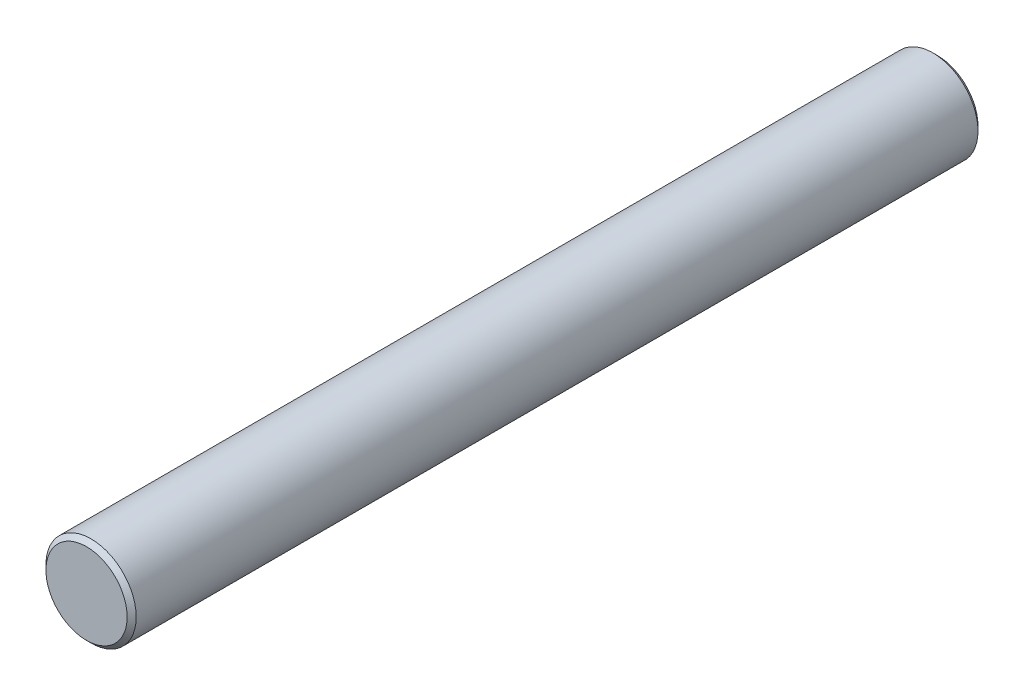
from build123d import *


with BuildPart() as part:
    # Esquisse1 → R_volution1 (revolve)
    with BuildSketch(Plane(origin=(0, 0, 0), x_dir=(1, 0, 0), z_dir=(0, 1, 0))):
        Polygon((7, 88.5), (0, 84.293975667), (0, -238.706024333), (18, -238.706024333), (20, -236.706024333), (20, 136.293975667), (18, 138.293975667), (7, 138.293975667), align=None)
    revolve(axis=Axis((0, 0, -138.5), (0, 0, 1)))


solid = part.part
